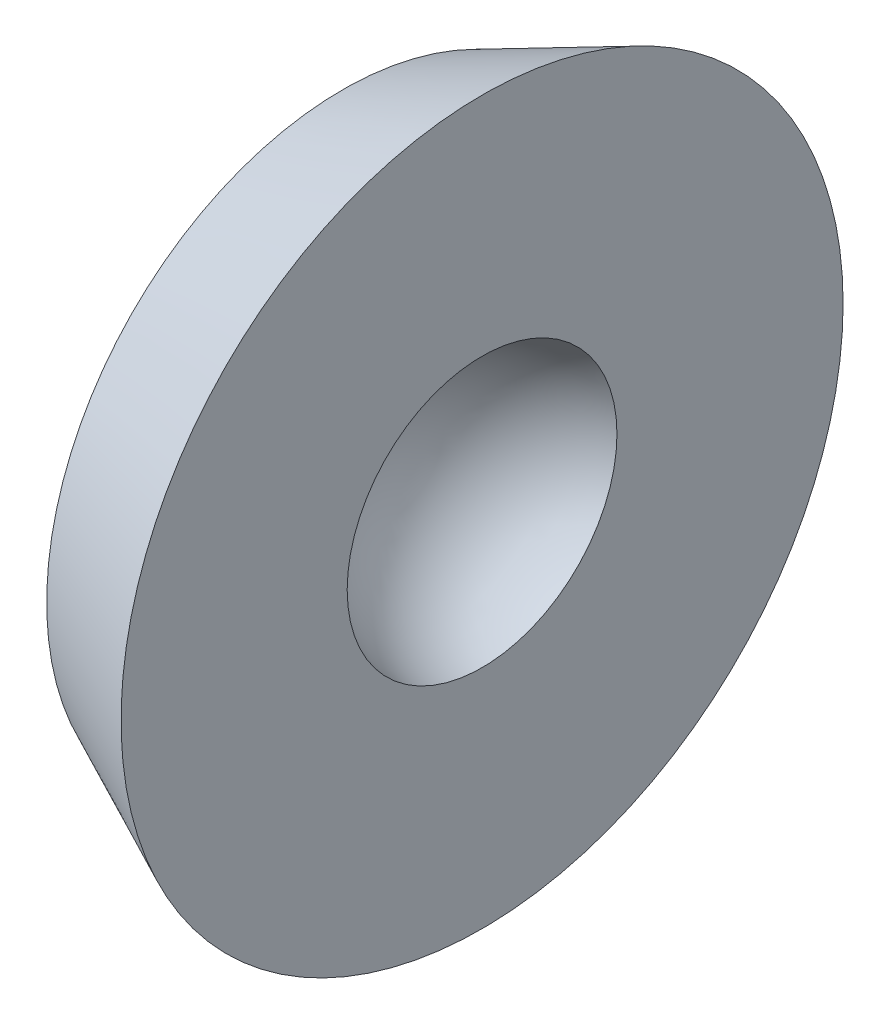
from build123d import *

# Parameters (mm, degrees)
SKETCH1_R           = 4.25
BOSS_EXTRUDE1_DEPTH = 2
BOSS_EXTRUDE1_DRAFT = -25


with BuildPart() as part:
    # Sketch1 → Boss-Extrude1 (with draft: the straight prism first)
    with BuildSketch(Plane(origin=(0, 0, 0), x_dir=(0, 0, -1), z_dir=(1, 0, 0))):
        Circle(SKETCH1_R)
    extrude(amount=BOSS_EXTRUDE1_DEPTH)
    # Boss-Extrude1: the draft: its side faces are tilted about the plane it starts from
    boss_extrude1_sides = [part.faces().sort_by_distance(p)[0] for p in [
        (1, 0, 4.25),
    ]]
    draft(boss_extrude1_sides, Plane(origin=(0, 0, 0), x_dir=(0, 0, -1), z_dir=(1, 0, 0)), BOSS_EXTRUDE1_DRAFT)

    # Sketch2 → Cut-Revolve1 (revolve, cut)
    with BuildSketch(Plane(origin=(0, 0, 0), x_dir=(1, 0, 0), z_dir=(0, 1, 0))):
        with BuildLine():
            Line((2, 0), (0.5, 0))
            ThreePointArc((0.5, 0), (0.91886117, 1.224744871), (2, 1.936491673))
            Line((2, 1.936491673), (2, 0))
        make_face()
    revolve(axis=Axis((2, 0, 0), (1, 0, 0)), mode=Mode.SUBTRACT)


solid = part.part
